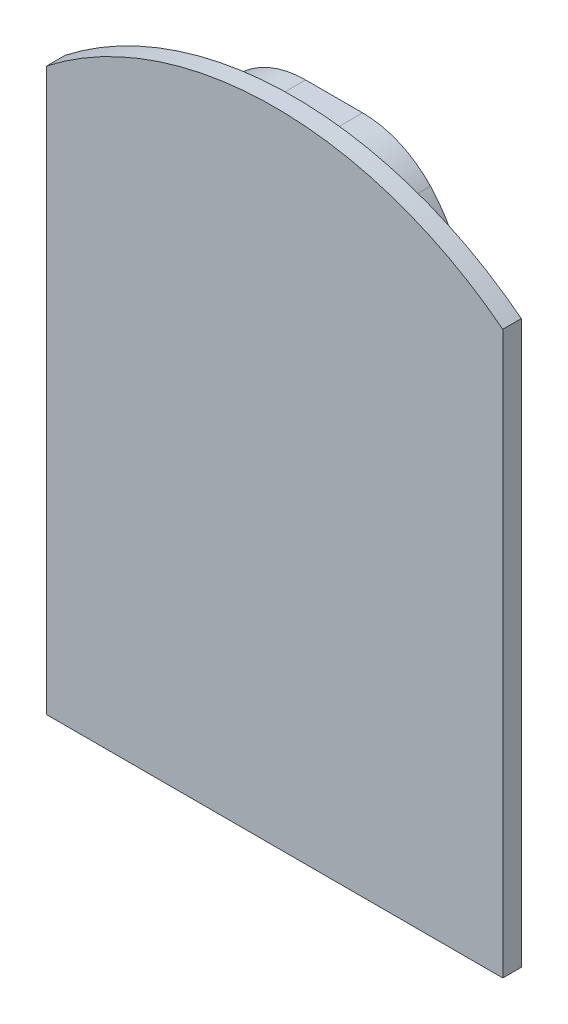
ISO-10303-21;
HEADER;
FILE_DESCRIPTION(('STEP AP214'),'2;1');
FILE_NAME('part.step','',(''),(''),'','','');
FILE_SCHEMA(('AUTOMOTIVE_DESIGN { 1 0 10303 214 1 1 1 1 }'));
ENDSEC;
DATA;
#1=APPLICATION_CONTEXT('core data for automotive mechanical design processes');
#2=APPLICATION_PROTOCOL_DEFINITION('international standard','automotive_design',2000,#1);
#3=PRODUCT_CONTEXT('',#1,'mechanical');
#4=PRODUCT('Part','Part','',(#3));
#5=PRODUCT_RELATED_PRODUCT_CATEGORY('part','',(#4));
#6=PRODUCT_DEFINITION_FORMATION('','',#4);
#7=PRODUCT_DEFINITION_CONTEXT('part definition',#1,'design');
#8=PRODUCT_DEFINITION('design','',#6,#7);
#9=PRODUCT_DEFINITION_SHAPE('','',#8);
#10=(LENGTH_UNIT() NAMED_UNIT(*) SI_UNIT(.MILLI.,.METRE.));
#11=(NAMED_UNIT(*) PLANE_ANGLE_UNIT() SI_UNIT($,.RADIAN.));
#12=(NAMED_UNIT(*) SI_UNIT($,.STERADIAN.) SOLID_ANGLE_UNIT());
#13=UNCERTAINTY_MEASURE_WITH_UNIT(LENGTH_MEASURE(1.E-05),#10,'distance_accuracy_value','');
#14=(GEOMETRIC_REPRESENTATION_CONTEXT(3) GLOBAL_UNCERTAINTY_ASSIGNED_CONTEXT((#13)) GLOBAL_UNIT_ASSIGNED_CONTEXT((#10,
#11,#12)) REPRESENTATION_CONTEXT('',''));
#15=CARTESIAN_POINT('',(0.,0.,0.));
#16=DIRECTION('',(0.,0.,1.));
#17=DIRECTION('',(1.,0.,0.));
#18=AXIS2_PLACEMENT_3D('',#15,#16,#17);
#19=CARTESIAN_POINT('',(12.3,-15.7705421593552,1.));
#20=DIRECTION('',(0.,0.,-1.));
#21=DIRECTION('',(-1.,0.,0.));
#22=AXIS2_PLACEMENT_3D('',#19,#20,#21);
#23=CYLINDRICAL_SURFACE('',#22,20.);
#24=CARTESIAN_POINT('',(12.3,-15.7705421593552,0.));
#25=DIRECTION('',(0.,0.,1.));
#26=DIRECTION('',(-1.,0.,0.));
#27=AXIS2_PLACEMENT_3D('',#24,#25,#26);
#28=CIRCLE('',#27,20.);
#29=CARTESIAN_POINT('',(24.6,0.,0.));
#30=VERTEX_POINT('',#29);
#31=CARTESIAN_POINT('',(0.,0.,0.));
#32=VERTEX_POINT('',#31);
#33=EDGE_CURVE('E131',#30,#32,#28,.T.);
#34=ORIENTED_EDGE('',*,*,#33,.T.);
#35=DIRECTION('',(0.,0.,-1.));
#36=VECTOR('',#35,1.);
#37=CARTESIAN_POINT('',(0.,0.,1.));
#38=LINE('',#37,#36);
#39=CARTESIAN_POINT('',(0.,0.,1.));
#40=VERTEX_POINT('',#39);
#41=EDGE_CURVE('E110',#40,#32,#38,.T.);
#42=ORIENTED_EDGE('',*,*,#41,.F.);
#43=CARTESIAN_POINT('',(12.3,-15.7705421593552,1.));
#44=DIRECTION('',(0.,0.,1.));
#45=DIRECTION('',(-1.,0.,0.));
#46=AXIS2_PLACEMENT_3D('',#43,#44,#45);
#47=CIRCLE('',#46,20.);
#48=CARTESIAN_POINT('',(24.6,0.,1.));
#49=VERTEX_POINT('',#48);
#50=EDGE_CURVE('E118',#49,#40,#47,.T.);
#51=ORIENTED_EDGE('',*,*,#50,.F.);
#52=DIRECTION('',(0.,0.,-1.));
#53=VECTOR('',#52,1.);
#54=CARTESIAN_POINT('',(24.6,0.,1.));
#55=LINE('',#54,#53);
#56=EDGE_CURVE('E214',#49,#30,#55,.T.);
#57=ORIENTED_EDGE('',*,*,#56,.T.);
#58=EDGE_LOOP('',(#34,#42,#51,#57));
#59=FACE_BOUND('',#58,.T.);
#60=ADVANCED_FACE('F39',(#59),#23,.T.);
#61=CARTESIAN_POINT('',(0.,0.,1.));
#62=DIRECTION('',(1.,0.,0.));
#63=DIRECTION('',(0.,1.,0.));
#64=AXIS2_PLACEMENT_3D('',#61,#62,#63);
#65=PLANE('',#64);
#66=DIRECTION('',(0.,-1.,0.));
#67=VECTOR('',#66,1.);
#68=CARTESIAN_POINT('',(0.,0.,0.));
#69=LINE('',#68,#67);
#70=CARTESIAN_POINT('',(0.,-30.3,0.));
#71=VERTEX_POINT('',#70);
#72=EDGE_CURVE('E217',#32,#71,#69,.T.);
#73=ORIENTED_EDGE('',*,*,#72,.T.);
#74=DIRECTION('',(0.,0.,-1.));
#75=VECTOR('',#74,1.);
#76=CARTESIAN_POINT('',(0.,-30.3,1.));
#77=LINE('',#76,#75);
#78=CARTESIAN_POINT('',(0.,-30.3,1.));
#79=VERTEX_POINT('',#78);
#80=EDGE_CURVE('E113',#79,#71,#77,.T.);
#81=ORIENTED_EDGE('',*,*,#80,.F.);
#82=DIRECTION('',(0.,-1.,0.));
#83=VECTOR('',#82,1.);
#84=CARTESIAN_POINT('',(0.,0.,1.));
#85=LINE('',#84,#83);
#86=EDGE_CURVE('E106',#40,#79,#85,.T.);
#87=ORIENTED_EDGE('',*,*,#86,.F.);
#88=ORIENTED_EDGE('',*,*,#41,.T.);
#89=EDGE_LOOP('',(#73,#81,#87,#88));
#90=FACE_BOUND('',#89,.T.);
#91=ADVANCED_FACE('F108',(#90),#65,.F.);
#92=CARTESIAN_POINT('',(0.,-30.3,1.));
#93=DIRECTION('',(0.,1.,0.));
#94=DIRECTION('',(0.,0.,1.));
#95=AXIS2_PLACEMENT_3D('',#92,#93,#94);
#96=PLANE('',#95);
#97=DIRECTION('',(1.,0.,0.));
#98=VECTOR('',#97,1.);
#99=CARTESIAN_POINT('',(0.,-30.3,0.));
#100=LINE('',#99,#98);
#101=CARTESIAN_POINT('',(24.6,-30.3,0.));
#102=VERTEX_POINT('',#101);
#103=EDGE_CURVE('E220',#71,#102,#100,.T.);
#104=ORIENTED_EDGE('',*,*,#103,.T.);
#105=DIRECTION('',(0.,0.,-1.));
#106=VECTOR('',#105,1.);
#107=CARTESIAN_POINT('',(24.6,-30.3,1.));
#108=LINE('',#107,#106);
#109=CARTESIAN_POINT('',(24.6,-30.3,1.));
#110=VERTEX_POINT('',#109);
#111=EDGE_CURVE('E140',#110,#102,#108,.T.);
#112=ORIENTED_EDGE('',*,*,#111,.F.);
#113=DIRECTION('',(1.,0.,0.));
#114=VECTOR('',#113,1.);
#115=CARTESIAN_POINT('',(0.,-30.3,1.));
#116=LINE('',#115,#114);
#117=EDGE_CURVE('E117',#79,#110,#116,.T.);
#118=ORIENTED_EDGE('',*,*,#117,.F.);
#119=ORIENTED_EDGE('',*,*,#80,.T.);
#120=EDGE_LOOP('',(#104,#112,#118,#119));
#121=FACE_BOUND('',#120,.T.);
#122=ADVANCED_FACE('F235',(#121),#96,.F.);
#123=CARTESIAN_POINT('',(24.6,-30.3,1.));
#124=DIRECTION('',(-1.,0.,0.));
#125=DIRECTION('',(0.,0.,1.));
#126=AXIS2_PLACEMENT_3D('',#123,#124,#125);
#127=PLANE('',#126);
#128=DIRECTION('',(0.,1.,0.));
#129=VECTOR('',#128,1.);
#130=CARTESIAN_POINT('',(24.6,-30.3,0.));
#131=LINE('',#130,#129);
#132=EDGE_CURVE('E128',#102,#30,#131,.T.);
#133=ORIENTED_EDGE('',*,*,#132,.T.);
#134=ORIENTED_EDGE('',*,*,#56,.F.);
#135=DIRECTION('',(0.,1.,0.));
#136=VECTOR('',#135,1.);
#137=CARTESIAN_POINT('',(24.6,-30.3,1.));
#138=LINE('',#137,#136);
#139=EDGE_CURVE('E123',#110,#49,#138,.T.);
#140=ORIENTED_EDGE('',*,*,#139,.F.);
#141=ORIENTED_EDGE('',*,*,#111,.T.);
#142=EDGE_LOOP('',(#133,#134,#140,#141));
#143=FACE_BOUND('',#142,.T.);
#144=ADVANCED_FACE('F231',(#143),#127,.F.);
#145=CARTESIAN_POINT('',(12.3,-15.7705421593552,1.));
#146=DIRECTION('',(0.,0.,-1.));
#147=DIRECTION('',(-1.,0.,0.));
#148=AXIS2_PLACEMENT_3D('',#145,#146,#147);
#149=PLANE('',#148);
#150=ORIENTED_EDGE('',*,*,#50,.T.);
#151=ORIENTED_EDGE('',*,*,#86,.T.);
#152=ORIENTED_EDGE('',*,*,#117,.T.);
#153=ORIENTED_EDGE('',*,*,#139,.T.);
#154=EDGE_LOOP('',(#150,#151,#152,#153));
#155=FACE_BOUND('',#154,.T.);
#156=ADVANCED_FACE('F121',(#155),#149,.F.);
#157=CARTESIAN_POINT('',(12.3,-15.7705421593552,0.));
#158=DIRECTION('',(0.,0.,-1.));
#159=DIRECTION('',(-1.,0.,0.));
#160=AXIS2_PLACEMENT_3D('',#157,#158,#159);
#161=PLANE('',#160);
#162=DIRECTION('',(1.,0.,0.));
#163=VECTOR('',#162,1.);
#164=CARTESIAN_POINT('',(15.3119880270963,3.12945784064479,0.));
#165=LINE('',#164,#163);
#166=CARTESIAN_POINT('',(10.7616078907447,3.12945784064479,0.));
#167=VERTEX_POINT('',#166);
#168=CARTESIAN_POINT('',(13.8383921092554,3.12945784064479,0.));
#169=VERTEX_POINT('',#168);
#170=EDGE_CURVE('E172',#167,#169,#165,.T.);
#171=ORIENTED_EDGE('',*,*,#170,.F.);
#172=CARTESIAN_POINT('',(10.7616078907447,-1.87054215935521,0.));
#173=DIRECTION('',(0.,0.,-1.));
#174=DIRECTION('',(-1.,0.,0.));
#175=AXIS2_PLACEMENT_3D('',#172,#173,#174);
#176=CIRCLE('',#175,5.);
#177=CARTESIAN_POINT('',(7.09876953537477,1.53292888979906,0.));
#178=VERTEX_POINT('',#177);
#179=EDGE_CURVE('E48',#167,#178,#176,.F.);
#180=ORIENTED_EDGE('',*,*,#179,.T.);
#181=CARTESIAN_POINT('',(12.3,-3.3,0.));
#182=DIRECTION('',(0.,0.,-1.));
#183=DIRECTION('',(-1.,0.,0.));
#184=AXIS2_PLACEMENT_3D('',#181,#182,#183);
#185=CIRCLE('',#184,7.1);
#186=CARTESIAN_POINT('',(17.5012304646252,1.53292888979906,0.));
#187=VERTEX_POINT('',#186);
#188=EDGE_CURVE('E170',#187,#178,#185,.T.);
#189=ORIENTED_EDGE('',*,*,#188,.F.);
#190=CARTESIAN_POINT('',(13.8383921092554,-1.87054215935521,0.));
#191=DIRECTION('',(0.,0.,-1.));
#192=DIRECTION('',(-1.,0.,0.));
#193=AXIS2_PLACEMENT_3D('',#190,#191,#192);
#194=CIRCLE('',#193,5.);
#195=EDGE_CURVE('E11',#187,#169,#194,.F.);
#196=ORIENTED_EDGE('',*,*,#195,.T.);
#197=EDGE_LOOP('',(#171,#180,#189,#196));
#198=FACE_BOUND('',#197,.T.);
#199=CARTESIAN_POINT('',(12.3,-21.3,0.));
#200=DIRECTION('',(0.,0.,-1.));
#201=DIRECTION('',(-1.,0.,0.));
#202=AXIS2_PLACEMENT_3D('',#199,#200,#201);
#203=CIRCLE('',#202,7.1);
#204=CARTESIAN_POINT('',(5.2,-21.3,0.));
#205=VERTEX_POINT('',#204);
#206=EDGE_CURVE('E196',#205,#205,#203,.T.);
#207=ORIENTED_EDGE('',*,*,#206,.F.);
#208=EDGE_LOOP('',(#207));
#209=FACE_BOUND('',#208,.T.);
#210=ORIENTED_EDGE('',*,*,#33,.F.);
#211=ORIENTED_EDGE('',*,*,#132,.F.);
#212=ORIENTED_EDGE('',*,*,#103,.F.);
#213=ORIENTED_EDGE('',*,*,#72,.F.);
#214=EDGE_LOOP('',(#210,#211,#212,#213));
#215=FACE_BOUND('',#214,.T.);
#216=ADVANCED_FACE('F168',(#198,#209,#215),#161,.T.);
#217=CARTESIAN_POINT('',(12.3,-21.3,-2.2));
#218=DIRECTION('',(0.,0.,-1.));
#219=DIRECTION('',(-1.,0.,0.));
#220=AXIS2_PLACEMENT_3D('',#217,#218,#219);
#221=PLANE('',#220);
#222=CARTESIAN_POINT('',(12.3,-21.3,-2.2));
#223=DIRECTION('',(0.,0.,-1.));
#224=DIRECTION('',(-1.,0.,0.));
#225=AXIS2_PLACEMENT_3D('',#222,#223,#224);
#226=CIRCLE('',#225,7.1);
#227=CARTESIAN_POINT('',(5.2,-21.3,-2.2));
#228=VERTEX_POINT('',#227);
#229=EDGE_CURVE('E203',#228,#228,#226,.T.);
#230=ORIENTED_EDGE('',*,*,#229,.T.);
#231=EDGE_LOOP('',(#230));
#232=FACE_BOUND('',#231,.T.);
#233=CARTESIAN_POINT('',(12.3,-21.3,-2.2));
#234=DIRECTION('',(0.,0.,-1.));
#235=DIRECTION('',(-1.,0.,0.));
#236=AXIS2_PLACEMENT_3D('',#233,#234,#235);
#237=CIRCLE('',#236,6.1);
#238=CARTESIAN_POINT('',(6.2,-21.3,-2.2));
#239=VERTEX_POINT('',#238);
#240=EDGE_CURVE('E191',#239,#239,#237,.T.);
#241=ORIENTED_EDGE('',*,*,#240,.F.);
#242=EDGE_LOOP('',(#241));
#243=FACE_BOUND('',#242,.T.);
#244=ADVANCED_FACE('F270',(#232,#243),#221,.T.);
#245=CARTESIAN_POINT('',(12.3,-21.3,-2.2));
#246=DIRECTION('',(0.,0.,1.));
#247=DIRECTION('',(1.,0.,0.));
#248=AXIS2_PLACEMENT_3D('',#245,#246,#247);
#249=CYLINDRICAL_SURFACE('',#248,7.1);
#250=ORIENTED_EDGE('',*,*,#229,.F.);
#251=EDGE_LOOP('',(#250));
#252=FACE_BOUND('',#251,.T.);
#253=ORIENTED_EDGE('',*,*,#206,.T.);
#254=EDGE_LOOP('',(#253));
#255=FACE_BOUND('',#254,.T.);
#256=ADVANCED_FACE('F275',(#252,#255),#249,.T.);
#257=CARTESIAN_POINT('',(12.3,-21.3,-2.2));
#258=DIRECTION('',(0.,0.,1.));
#259=DIRECTION('',(1.,0.,0.));
#260=AXIS2_PLACEMENT_3D('',#257,#258,#259);
#261=CYLINDRICAL_SURFACE('',#260,6.1);
#262=ORIENTED_EDGE('',*,*,#240,.T.);
#263=EDGE_LOOP('',(#262));
#264=FACE_BOUND('',#263,.T.);
#265=CARTESIAN_POINT('',(12.3,-21.3,0.));
#266=DIRECTION('',(0.,0.,-1.));
#267=DIRECTION('',(-1.,0.,0.));
#268=AXIS2_PLACEMENT_3D('',#265,#266,#267);
#269=CIRCLE('',#268,6.1);
#270=CARTESIAN_POINT('',(6.2,-21.3,0.));
#271=VERTEX_POINT('',#270);
#272=EDGE_CURVE('E133',#271,#271,#269,.F.);
#273=ORIENTED_EDGE('',*,*,#272,.T.);
#274=EDGE_LOOP('',(#273));
#275=FACE_BOUND('',#274,.T.);
#276=ADVANCED_FACE('F267',(#264,#275),#261,.F.);
#277=ORIENTED_EDGE('',*,*,#272,.F.);
#278=EDGE_LOOP('',(#277));
#279=FACE_BOUND('',#278,.T.);
#280=ADVANCED_FACE('F258',(#279),#161,.T.);
#281=CARTESIAN_POINT('',(12.3,-3.3,-2.2));
#282=DIRECTION('',(0.,0.,-1.));
#283=DIRECTION('',(-1.,0.,0.));
#284=AXIS2_PLACEMENT_3D('',#281,#282,#283);
#285=PLANE('',#284);
#286=CARTESIAN_POINT('',(12.3,-3.3,-2.2));
#287=DIRECTION('',(0.,0.,-1.));
#288=DIRECTION('',(-1.,0.,0.));
#289=AXIS2_PLACEMENT_3D('',#286,#287,#288);
#290=CIRCLE('',#289,7.1);
#291=CARTESIAN_POINT('',(17.5012304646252,1.53292888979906,-2.2));
#292=VERTEX_POINT('',#291);
#293=CARTESIAN_POINT('',(7.09876953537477,1.53292888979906,-2.2));
#294=VERTEX_POINT('',#293);
#295=EDGE_CURVE('E186',#292,#294,#290,.T.);
#296=ORIENTED_EDGE('',*,*,#295,.T.);
#297=CARTESIAN_POINT('',(10.7616078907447,-1.87054215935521,-2.2));
#298=DIRECTION('',(0.,0.,-1.));
#299=DIRECTION('',(-1.,0.,0.));
#300=AXIS2_PLACEMENT_3D('',#297,#298,#299);
#301=CIRCLE('',#300,5.);
#302=CARTESIAN_POINT('',(10.7616078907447,3.12945784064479,-2.2));
#303=VERTEX_POINT('',#302);
#304=EDGE_CURVE('E162',#294,#303,#301,.T.);
#305=ORIENTED_EDGE('',*,*,#304,.T.);
#306=DIRECTION('',(1.,0.,0.));
#307=VECTOR('',#306,1.);
#308=CARTESIAN_POINT('',(15.3119880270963,3.12945784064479,-2.2));
#309=LINE('',#308,#307);
#310=CARTESIAN_POINT('',(13.8383921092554,3.12945784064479,-2.2));
#311=VERTEX_POINT('',#310);
#312=EDGE_CURVE('E185',#303,#311,#309,.T.);
#313=ORIENTED_EDGE('',*,*,#312,.T.);
#314=CARTESIAN_POINT('',(13.8383921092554,-1.87054215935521,-2.2));
#315=DIRECTION('',(0.,0.,-1.));
#316=DIRECTION('',(-1.,0.,0.));
#317=AXIS2_PLACEMENT_3D('',#314,#315,#316);
#318=CIRCLE('',#317,5.);
#319=EDGE_CURVE('E62',#311,#292,#318,.T.);
#320=ORIENTED_EDGE('',*,*,#319,.T.);
#321=EDGE_LOOP('',(#296,#305,#313,#320));
#322=FACE_BOUND('',#321,.T.);
#323=CARTESIAN_POINT('',(12.3,-3.3,-2.2));
#324=DIRECTION('',(0.,0.,-1.));
#325=DIRECTION('',(-1.,0.,0.));
#326=AXIS2_PLACEMENT_3D('',#323,#324,#325);
#327=CIRCLE('',#326,6.1);
#328=CARTESIAN_POINT('',(6.2,-3.3,-2.2));
#329=VERTEX_POINT('',#328);
#330=EDGE_CURVE('E178',#329,#329,#327,.T.);
#331=ORIENTED_EDGE('',*,*,#330,.F.);
#332=EDGE_LOOP('',(#331));
#333=FACE_BOUND('',#332,.T.);
#334=ADVANCED_FACE('F183',(#322,#333),#285,.T.);
#335=CARTESIAN_POINT('',(12.3,-3.3,-2.2));
#336=DIRECTION('',(0.,0.,1.));
#337=DIRECTION('',(1.,0.,0.));
#338=AXIS2_PLACEMENT_3D('',#335,#336,#337);
#339=CYLINDRICAL_SURFACE('',#338,7.1);
#340=ORIENTED_EDGE('',*,*,#188,.T.);
#341=DIRECTION('',(0.,0.,1.));
#342=VECTOR('',#341,1.);
#343=CARTESIAN_POINT('',(7.09876953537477,1.53292888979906,-2.2));
#344=LINE('',#343,#342);
#345=EDGE_CURVE('E55',#178,#294,#344,.F.);
#346=ORIENTED_EDGE('',*,*,#345,.T.);
#347=ORIENTED_EDGE('',*,*,#295,.F.);
#348=DIRECTION('',(0.,0.,1.));
#349=VECTOR('',#348,1.);
#350=CARTESIAN_POINT('',(17.5012304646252,1.53292888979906,-2.2));
#351=LINE('',#350,#349);
#352=EDGE_CURVE('E154',#292,#187,#351,.T.);
#353=ORIENTED_EDGE('',*,*,#352,.T.);
#354=EDGE_LOOP('',(#340,#346,#347,#353));
#355=FACE_BOUND('',#354,.T.);
#356=ADVANCED_FACE('F175',(#355),#339,.T.);
#357=CARTESIAN_POINT('',(15.3119880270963,3.12945784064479,-2.2));
#358=DIRECTION('',(0.,-1.,0.));
#359=DIRECTION('',(1.,0.,0.));
#360=AXIS2_PLACEMENT_3D('',#357,#358,#359);
#361=PLANE('',#360);
#362=ORIENTED_EDGE('',*,*,#312,.F.);
#363=DIRECTION('',(0.,0.,1.));
#364=VECTOR('',#363,1.);
#365=CARTESIAN_POINT('',(10.7616078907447,3.12945784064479,-2.2));
#366=LINE('',#365,#364);
#367=EDGE_CURVE('E150',#303,#167,#366,.T.);
#368=ORIENTED_EDGE('',*,*,#367,.T.);
#369=ORIENTED_EDGE('',*,*,#170,.T.);
#370=DIRECTION('',(0.,0.,1.));
#371=VECTOR('',#370,1.);
#372=CARTESIAN_POINT('',(13.8383921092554,3.12945784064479,-2.2));
#373=LINE('',#372,#371);
#374=EDGE_CURVE('E147',#169,#311,#373,.F.);
#375=ORIENTED_EDGE('',*,*,#374,.T.);
#376=EDGE_LOOP('',(#362,#368,#369,#375));
#377=FACE_BOUND('',#376,.T.);
#378=ADVANCED_FACE('F188',(#377),#361,.F.);
#379=CARTESIAN_POINT('',(12.3,-3.3,-2.2));
#380=DIRECTION('',(0.,0.,1.));
#381=DIRECTION('',(1.,0.,0.));
#382=AXIS2_PLACEMENT_3D('',#379,#380,#381);
#383=CYLINDRICAL_SURFACE('',#382,6.1);
#384=ORIENTED_EDGE('',*,*,#330,.T.);
#385=EDGE_LOOP('',(#384));
#386=FACE_BOUND('',#385,.T.);
#387=CARTESIAN_POINT('',(12.3,-3.3,0.));
#388=DIRECTION('',(0.,0.,-1.));
#389=DIRECTION('',(-1.,0.,0.));
#390=AXIS2_PLACEMENT_3D('',#387,#388,#389);
#391=CIRCLE('',#390,6.1);
#392=CARTESIAN_POINT('',(6.2,-3.3,0.));
#393=VERTEX_POINT('',#392);
#394=EDGE_CURVE('E138',#393,#393,#391,.F.);
#395=ORIENTED_EDGE('',*,*,#394,.T.);
#396=EDGE_LOOP('',(#395));
#397=FACE_BOUND('',#396,.T.);
#398=ADVANCED_FACE('F255',(#386,#397),#383,.F.);
#399=ORIENTED_EDGE('',*,*,#394,.F.);
#400=EDGE_LOOP('',(#399));
#401=FACE_BOUND('',#400,.T.);
#402=ADVANCED_FACE('F249',(#401),#161,.T.);
#403=CARTESIAN_POINT('',(10.7616078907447,-1.87054215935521,-2.2));
#404=DIRECTION('',(0.,0.,1.));
#405=DIRECTION('',(1.,0.,0.));
#406=AXIS2_PLACEMENT_3D('',#403,#404,#405);
#407=CYLINDRICAL_SURFACE('',#406,5.);
#408=ORIENTED_EDGE('',*,*,#304,.F.);
#409=ORIENTED_EDGE('',*,*,#345,.F.);
#410=ORIENTED_EDGE('',*,*,#179,.F.);
#411=ORIENTED_EDGE('',*,*,#367,.F.);
#412=EDGE_LOOP('',(#408,#409,#410,#411));
#413=FACE_BOUND('',#412,.T.);
#414=ADVANCED_FACE('F181',(#413),#407,.T.);
#415=CARTESIAN_POINT('',(13.8383921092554,-1.87054215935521,-2.2));
#416=DIRECTION('',(0.,0.,1.));
#417=DIRECTION('',(1.,0.,0.));
#418=AXIS2_PLACEMENT_3D('',#415,#416,#417);
#419=CYLINDRICAL_SURFACE('',#418,5.);
#420=ORIENTED_EDGE('',*,*,#319,.F.);
#421=ORIENTED_EDGE('',*,*,#374,.F.);
#422=ORIENTED_EDGE('',*,*,#195,.F.);
#423=ORIENTED_EDGE('',*,*,#352,.F.);
#424=EDGE_LOOP('',(#420,#421,#422,#423));
#425=FACE_BOUND('',#424,.T.);
#426=ADVANCED_FACE('F41',(#425),#419,.T.);
#427=CLOSED_SHELL('',(#60,#91,#122,#144,#156,#216,#244,#256,#276,#280,#334,#356,#378,#398,#402,
#414,#426));
#428=MANIFOLD_SOLID_BREP('B2',#427);
#429=ADVANCED_BREP_SHAPE_REPRESENTATION('',(#18,#428),#14);
#430=SHAPE_DEFINITION_REPRESENTATION(#9,#429);
ENDSEC;
END-ISO-10303-21;
